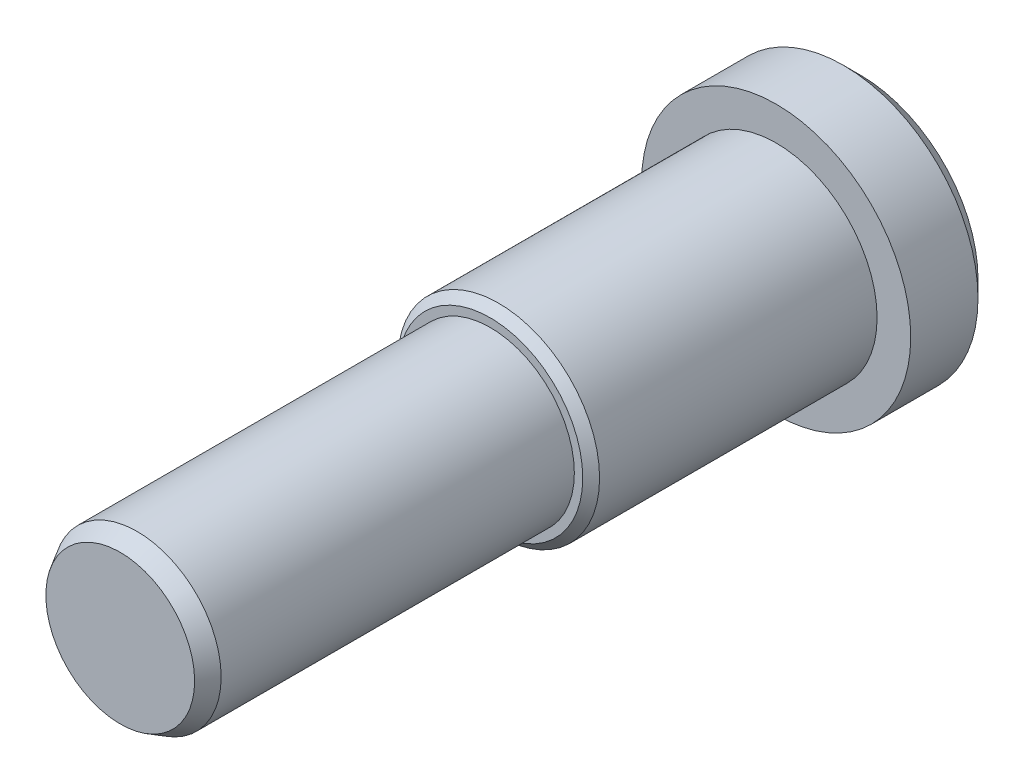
from build123d import *

# Parameters (mm, degrees)
ESQUISSE1_R      = 8
EXTRUSION1_DEPTH = 5
CHANFREIN1_SIZE  = 1
ESQUISSE3_R      = 6
EXTRUSION2_DEPTH = 17
ESQUISSE4_R      = 5
EXTRUSION3_DEPTH = 22
CHANFREIN2_SIZE  = 1
CHANFREIN2_SIZE2 = 0.577350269
CHANFREIN3_SIZE  = 0.5


with BuildPart() as part:
    # Esquisse1 → Extrusion1 (new body)
    with BuildSketch(Plane.XY):
        Circle(ESQUISSE1_R)
    extrude(amount=-EXTRUSION1_DEPTH)

    # Chanfrein1
    chanfrein1_edges = [part.edges().sort_by_distance(p)[0] for p in [
        (-8, 0, -5),
    ]]
    chamfer(chanfrein1_edges, length=CHANFREIN1_SIZE)

    # Esquisse3 → Extrusion2 (add)
    with BuildSketch(Plane.XY):
        Circle(ESQUISSE3_R)
    extrude(amount=EXTRUSION2_DEPTH)

    # Esquisse4 → Extrusion3 (add)
    with BuildSketch(Plane.XY.offset(17)):
        Circle(ESQUISSE4_R)
    extrude(amount=EXTRUSION3_DEPTH)

    # Chanfrein2
    chanfrein2_edges = [part.edges().sort_by_distance(p)[0] for p in [
        (-5, 0, 39),
    ]]
    chanfrein2_side = [part.faces().sort_by_distance(p)[0] for p in [
        (-5, 0, 28),
    ]]
    chamfer(chanfrein2_edges, length=CHANFREIN2_SIZE, length2=CHANFREIN2_SIZE2, reference=chanfrein2_side[0])

    # Chanfrein3
    chanfrein3_edges = [part.edges().sort_by_distance(p)[0] for p in [
        (-6, 0, 17),
    ]]
    chamfer(chanfrein3_edges, length=CHANFREIN3_SIZE)


solid = part.part
